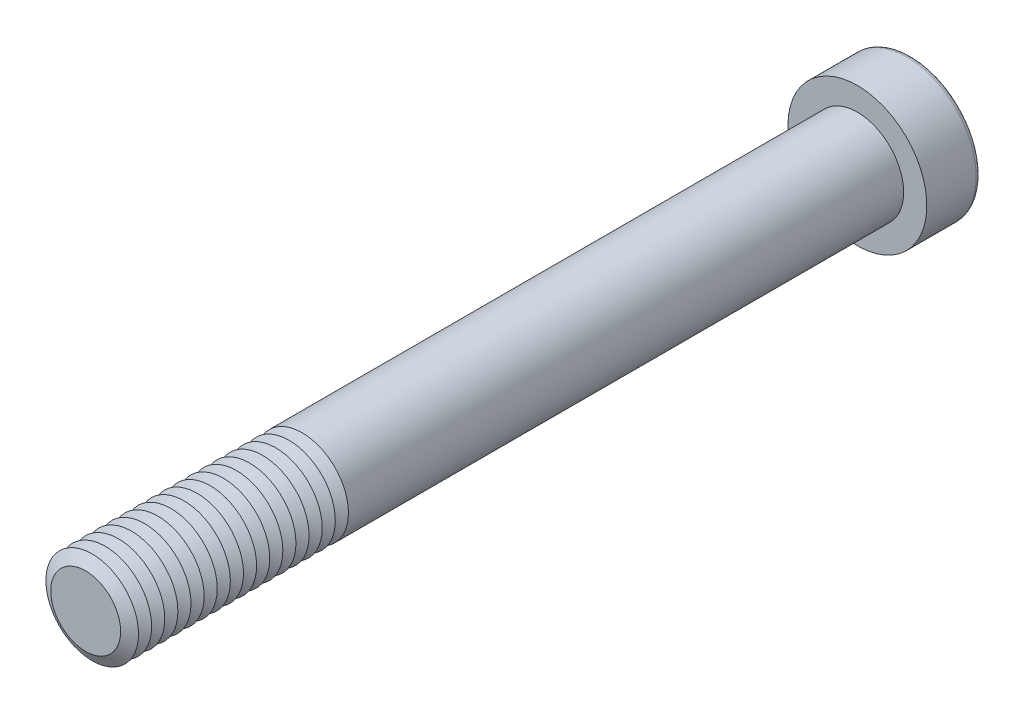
ISO-10303-21;
HEADER;
FILE_DESCRIPTION(('STEP AP214'),'2;1');
FILE_NAME('part.step','',(''),(''),'','','');
FILE_SCHEMA(('AUTOMOTIVE_DESIGN { 1 0 10303 214 1 1 1 1 }'));
ENDSEC;
DATA;
#1=APPLICATION_CONTEXT('core data for automotive mechanical design processes');
#2=APPLICATION_PROTOCOL_DEFINITION('international standard','automotive_design',2000,#1);
#3=PRODUCT_CONTEXT('',#1,'mechanical');
#4=PRODUCT('Part','Part','',(#3));
#5=PRODUCT_RELATED_PRODUCT_CATEGORY('part','',(#4));
#6=PRODUCT_DEFINITION_FORMATION('','',#4);
#7=PRODUCT_DEFINITION_CONTEXT('part definition',#1,'design');
#8=PRODUCT_DEFINITION('design','',#6,#7);
#9=PRODUCT_DEFINITION_SHAPE('','',#8);
#10=(LENGTH_UNIT() NAMED_UNIT(*) SI_UNIT(.MILLI.,.METRE.));
#11=(NAMED_UNIT(*) PLANE_ANGLE_UNIT() SI_UNIT($,.RADIAN.));
#12=(NAMED_UNIT(*) SI_UNIT($,.STERADIAN.) SOLID_ANGLE_UNIT());
#13=UNCERTAINTY_MEASURE_WITH_UNIT(LENGTH_MEASURE(1.E-05),#10,'distance_accuracy_value','');
#14=(GEOMETRIC_REPRESENTATION_CONTEXT(3) GLOBAL_UNCERTAINTY_ASSIGNED_CONTEXT((#13)) GLOBAL_UNIT_ASSIGNED_CONTEXT((#10,
#11,#12)) REPRESENTATION_CONTEXT('',''));
#15=CARTESIAN_POINT('',(0.,0.,0.));
#16=DIRECTION('',(0.,0.,1.));
#17=DIRECTION('',(1.,0.,0.));
#18=AXIS2_PLACEMENT_3D('',#15,#16,#17);
#19=CARTESIAN_POINT('',(0.,0.,94.05));
#20=DIRECTION('',(0.,0.,1.));
#21=DIRECTION('',(1.,0.,0.));
#22=AXIS2_PLACEMENT_3D('',#19,#20,#21);
#23=CONICAL_SURFACE('',#22,6.,1.0471975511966);
#24=CARTESIAN_POINT('',(0.,0.,93.2));
#25=DIRECTION('',(0.,0.,1.));
#26=DIRECTION('',(1.,0.,0.));
#27=AXIS2_PLACEMENT_3D('',#24,#25,#26);
#28=CIRCLE('',#27,4.52775681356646);
#29=CARTESIAN_POINT('',(4.52775681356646,0.,93.2));
#30=VERTEX_POINT('',#29);
#31=EDGE_CURVE('E313',#30,#30,#28,.T.);
#32=ORIENTED_EDGE('',*,*,#31,.T.);
#33=EDGE_LOOP('',(#32));
#34=FACE_BOUND('',#33,.T.);
#35=CARTESIAN_POINT('',(0.,0.,94.05));
#36=DIRECTION('',(0.,0.,1.));
#37=DIRECTION('',(1.,0.,0.));
#38=AXIS2_PLACEMENT_3D('',#35,#36,#37);
#39=CIRCLE('',#38,6.);
#40=CARTESIAN_POINT('',(6.,0.,94.05));
#41=VERTEX_POINT('',#40);
#42=EDGE_CURVE('E316',#41,#41,#39,.T.);
#43=ORIENTED_EDGE('',*,*,#42,.F.);
#44=EDGE_LOOP('',(#43));
#45=FACE_BOUND('',#44,.T.);
#46=ADVANCED_FACE('F39',(#34,#45),#23,.T.);
#47=CARTESIAN_POINT('',(0.,0.,93.2));
#48=DIRECTION('',(0.,0.,-1.));
#49=DIRECTION('',(-1.,0.,0.));
#50=AXIS2_PLACEMENT_3D('',#47,#48,#49);
#51=CONICAL_SURFACE('',#50,4.52775681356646,1.04719755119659);
#52=CARTESIAN_POINT('',(0.,0.,92.35));
#53=DIRECTION('',(0.,0.,1.));
#54=DIRECTION('',(1.,0.,0.));
#55=AXIS2_PLACEMENT_3D('',#52,#53,#54);
#56=CIRCLE('',#55,6.);
#57=CARTESIAN_POINT('',(6.,0.,92.35));
#58=VERTEX_POINT('',#57);
#59=EDGE_CURVE('E323',#58,#58,#56,.T.);
#60=ORIENTED_EDGE('',*,*,#59,.T.);
#61=EDGE_LOOP('',(#60));
#62=FACE_BOUND('',#61,.T.);
#63=ORIENTED_EDGE('',*,*,#31,.F.);
#64=EDGE_LOOP('',(#63));
#65=FACE_BOUND('',#64,.T.);
#66=ADVANCED_FACE('F244',(#62,#65),#51,.T.);
#67=CARTESIAN_POINT('',(0.,0.,100.));
#68=DIRECTION('',(0.,0.,1.));
#69=DIRECTION('',(1.,0.,0.));
#70=AXIS2_PLACEMENT_3D('',#67,#68,#69);
#71=PLANE('',#70);
#72=CARTESIAN_POINT('',(0.,0.,100.));
#73=DIRECTION('',(0.,0.,1.));
#74=DIRECTION('',(1.,0.,0.));
#75=AXIS2_PLACEMENT_3D('',#72,#73,#74);
#76=CIRCLE('',#75,4.52775681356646);
#77=CARTESIAN_POINT('',(4.52775681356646,0.,100.));
#78=VERTEX_POINT('',#77);
#79=EDGE_CURVE('E174',#78,#78,#76,.T.);
#80=ORIENTED_EDGE('',*,*,#79,.T.);
#81=EDGE_LOOP('',(#80));
#82=FACE_BOUND('',#81,.T.);
#83=ADVANCED_FACE('F250',(#82),#71,.T.);
#84=CARTESIAN_POINT('',(0.,0.,100.));
#85=DIRECTION('',(0.,0.,-1.));
#86=DIRECTION('',(-1.,0.,0.));
#87=AXIS2_PLACEMENT_3D('',#84,#85,#86);
#88=CONICAL_SURFACE('',#87,4.52775681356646,1.04719755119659);
#89=CARTESIAN_POINT('',(0.,0.,99.15));
#90=DIRECTION('',(0.,0.,1.));
#91=DIRECTION('',(1.,0.,0.));
#92=AXIS2_PLACEMENT_3D('',#89,#90,#91);
#93=CIRCLE('',#92,6.);
#94=CARTESIAN_POINT('',(6.,0.,99.15));
#95=VERTEX_POINT('',#94);
#96=EDGE_CURVE('E290',#95,#95,#93,.T.);
#97=ORIENTED_EDGE('',*,*,#96,.T.);
#98=EDGE_LOOP('',(#97));
#99=FACE_BOUND('',#98,.T.);
#100=ORIENTED_EDGE('',*,*,#79,.F.);
#101=EDGE_LOOP('',(#100));
#102=FACE_BOUND('',#101,.T.);
#103=ADVANCED_FACE('F199',(#99,#102),#88,.T.);
#104=CARTESIAN_POINT('',(0.,0.,99.15));
#105=DIRECTION('',(0.,0.,1.));
#106=DIRECTION('',(1.,0.,0.));
#107=AXIS2_PLACEMENT_3D('',#104,#105,#106);
#108=CONICAL_SURFACE('',#107,6.,1.0471975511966);
#109=CARTESIAN_POINT('',(0.,0.,98.3));
#110=DIRECTION('',(0.,0.,1.));
#111=DIRECTION('',(1.,0.,0.));
#112=AXIS2_PLACEMENT_3D('',#109,#110,#111);
#113=CIRCLE('',#112,4.52775681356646);
#114=CARTESIAN_POINT('',(4.52775681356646,0.,98.3));
#115=VERTEX_POINT('',#114);
#116=EDGE_CURVE('E287',#115,#115,#113,.T.);
#117=ORIENTED_EDGE('',*,*,#116,.T.);
#118=EDGE_LOOP('',(#117));
#119=FACE_BOUND('',#118,.T.);
#120=ORIENTED_EDGE('',*,*,#96,.F.);
#121=EDGE_LOOP('',(#120));
#122=FACE_BOUND('',#121,.T.);
#123=ADVANCED_FACE('F276',(#119,#122),#108,.T.);
#124=CARTESIAN_POINT('',(0.,0.,98.3));
#125=DIRECTION('',(0.,0.,-1.));
#126=DIRECTION('',(-1.,0.,0.));
#127=AXIS2_PLACEMENT_3D('',#124,#125,#126);
#128=CONICAL_SURFACE('',#127,4.52775681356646,1.04719755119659);
#129=CARTESIAN_POINT('',(0.,0.,97.45));
#130=DIRECTION('',(0.,0.,1.));
#131=DIRECTION('',(1.,0.,0.));
#132=AXIS2_PLACEMENT_3D('',#129,#130,#131);
#133=CIRCLE('',#132,6.);
#134=CARTESIAN_POINT('',(6.,0.,97.45));
#135=VERTEX_POINT('',#134);
#136=EDGE_CURVE('E299',#135,#135,#133,.T.);
#137=ORIENTED_EDGE('',*,*,#136,.T.);
#138=EDGE_LOOP('',(#137));
#139=FACE_BOUND('',#138,.T.);
#140=ORIENTED_EDGE('',*,*,#116,.F.);
#141=EDGE_LOOP('',(#140));
#142=FACE_BOUND('',#141,.T.);
#143=ADVANCED_FACE('F273',(#139,#142),#128,.T.);
#144=CARTESIAN_POINT('',(0.,0.,97.45));
#145=DIRECTION('',(0.,0.,1.));
#146=DIRECTION('',(1.,0.,0.));
#147=AXIS2_PLACEMENT_3D('',#144,#145,#146);
#148=CONICAL_SURFACE('',#147,6.,1.0471975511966);
#149=CARTESIAN_POINT('',(0.,0.,96.6));
#150=DIRECTION('',(0.,0.,1.));
#151=DIRECTION('',(1.,0.,0.));
#152=AXIS2_PLACEMENT_3D('',#149,#150,#151);
#153=CIRCLE('',#152,4.52775681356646);
#154=CARTESIAN_POINT('',(4.52775681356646,0.,96.6));
#155=VERTEX_POINT('',#154);
#156=EDGE_CURVE('E292',#155,#155,#153,.T.);
#157=ORIENTED_EDGE('',*,*,#156,.T.);
#158=EDGE_LOOP('',(#157));
#159=FACE_BOUND('',#158,.T.);
#160=ORIENTED_EDGE('',*,*,#136,.F.);
#161=EDGE_LOOP('',(#160));
#162=FACE_BOUND('',#161,.T.);
#163=ADVANCED_FACE('F269',(#159,#162),#148,.T.);
#164=CARTESIAN_POINT('',(0.,0.,96.6));
#165=DIRECTION('',(0.,0.,-1.));
#166=DIRECTION('',(-1.,0.,0.));
#167=AXIS2_PLACEMENT_3D('',#164,#165,#166);
#168=CONICAL_SURFACE('',#167,4.52775681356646,1.04719755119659);
#169=CARTESIAN_POINT('',(0.,0.,95.75));
#170=DIRECTION('',(0.,0.,1.));
#171=DIRECTION('',(1.,0.,0.));
#172=AXIS2_PLACEMENT_3D('',#169,#170,#171);
#173=CIRCLE('',#172,6.);
#174=CARTESIAN_POINT('',(6.,0.,95.75));
#175=VERTEX_POINT('',#174);
#176=EDGE_CURVE('E309',#175,#175,#173,.T.);
#177=ORIENTED_EDGE('',*,*,#176,.T.);
#178=EDGE_LOOP('',(#177));
#179=FACE_BOUND('',#178,.T.);
#180=ORIENTED_EDGE('',*,*,#156,.F.);
#181=EDGE_LOOP('',(#180));
#182=FACE_BOUND('',#181,.T.);
#183=ADVANCED_FACE('F265',(#179,#182),#168,.T.);
#184=CARTESIAN_POINT('',(0.,0.,95.75));
#185=DIRECTION('',(0.,0.,1.));
#186=DIRECTION('',(1.,0.,0.));
#187=AXIS2_PLACEMENT_3D('',#184,#185,#186);
#188=CONICAL_SURFACE('',#187,6.,1.0471975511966);
#189=CARTESIAN_POINT('',(0.,0.,94.9));
#190=DIRECTION('',(0.,0.,1.));
#191=DIRECTION('',(1.,0.,0.));
#192=AXIS2_PLACEMENT_3D('',#189,#190,#191);
#193=CIRCLE('',#192,4.52775681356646);
#194=CARTESIAN_POINT('',(4.52775681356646,0.,94.9));
#195=VERTEX_POINT('',#194);
#196=EDGE_CURVE('E305',#195,#195,#193,.T.);
#197=ORIENTED_EDGE('',*,*,#196,.T.);
#198=EDGE_LOOP('',(#197));
#199=FACE_BOUND('',#198,.T.);
#200=ORIENTED_EDGE('',*,*,#176,.F.);
#201=EDGE_LOOP('',(#200));
#202=FACE_BOUND('',#201,.T.);
#203=ADVANCED_FACE('F261',(#199,#202),#188,.T.);
#204=CARTESIAN_POINT('',(0.,0.,94.9));
#205=DIRECTION('',(0.,0.,-1.));
#206=DIRECTION('',(-1.,0.,0.));
#207=AXIS2_PLACEMENT_3D('',#204,#205,#206);
#208=CONICAL_SURFACE('',#207,4.52775681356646,1.04719755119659);
#209=ORIENTED_EDGE('',*,*,#42,.T.);
#210=EDGE_LOOP('',(#209));
#211=FACE_BOUND('',#210,.T.);
#212=ORIENTED_EDGE('',*,*,#196,.F.);
#213=EDGE_LOOP('',(#212));
#214=FACE_BOUND('',#213,.T.);
#215=ADVANCED_FACE('F257',(#211,#214),#208,.T.);
#216=CARTESIAN_POINT('',(0.,0.,92.35));
#217=DIRECTION('',(0.,0.,1.));
#218=DIRECTION('',(1.,0.,0.));
#219=AXIS2_PLACEMENT_3D('',#216,#217,#218);
#220=CONICAL_SURFACE('',#219,6.,1.0471975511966);
#221=CARTESIAN_POINT('',(0.,0.,91.5));
#222=DIRECTION('',(0.,0.,1.));
#223=DIRECTION('',(1.,0.,0.));
#224=AXIS2_PLACEMENT_3D('',#221,#222,#223);
#225=CIRCLE('',#224,4.52775681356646);
#226=CARTESIAN_POINT('',(4.52775681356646,0.,91.5));
#227=VERTEX_POINT('',#226);
#228=EDGE_CURVE('E320',#227,#227,#225,.T.);
#229=ORIENTED_EDGE('',*,*,#228,.T.);
#230=EDGE_LOOP('',(#229));
#231=FACE_BOUND('',#230,.T.);
#232=ORIENTED_EDGE('',*,*,#59,.F.);
#233=EDGE_LOOP('',(#232));
#234=FACE_BOUND('',#233,.T.);
#235=ADVANCED_FACE('F260',(#231,#234),#220,.T.);
#236=CARTESIAN_POINT('',(0.,0.,91.5));
#237=DIRECTION('',(0.,0.,-1.));
#238=DIRECTION('',(-1.,0.,0.));
#239=AXIS2_PLACEMENT_3D('',#236,#237,#238);
#240=CONICAL_SURFACE('',#239,4.52775681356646,1.04719755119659);
#241=CARTESIAN_POINT('',(0.,0.,90.65));
#242=DIRECTION('',(0.,0.,1.));
#243=DIRECTION('',(1.,0.,0.));
#244=AXIS2_PLACEMENT_3D('',#241,#242,#243);
#245=CIRCLE('',#244,6.);
#246=CARTESIAN_POINT('',(6.,0.,90.65));
#247=VERTEX_POINT('',#246);
#248=EDGE_CURVE('E330',#247,#247,#245,.T.);
#249=ORIENTED_EDGE('',*,*,#248,.T.);
#250=EDGE_LOOP('',(#249));
#251=FACE_BOUND('',#250,.T.);
#252=ORIENTED_EDGE('',*,*,#228,.F.);
#253=EDGE_LOOP('',(#252));
#254=FACE_BOUND('',#253,.T.);
#255=ADVANCED_FACE('F510',(#251,#254),#240,.T.);
#256=CARTESIAN_POINT('',(0.,0.,90.65));
#257=DIRECTION('',(0.,0.,1.));
#258=DIRECTION('',(1.,0.,0.));
#259=AXIS2_PLACEMENT_3D('',#256,#257,#258);
#260=CONICAL_SURFACE('',#259,6.,1.0471975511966);
#261=CARTESIAN_POINT('',(0.,0.,89.8));
#262=DIRECTION('',(0.,0.,1.));
#263=DIRECTION('',(1.,0.,0.));
#264=AXIS2_PLACEMENT_3D('',#261,#262,#263);
#265=CIRCLE('',#264,4.52775681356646);
#266=CARTESIAN_POINT('',(4.52775681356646,0.,89.8));
#267=VERTEX_POINT('',#266);
#268=EDGE_CURVE('E326',#267,#267,#265,.T.);
#269=ORIENTED_EDGE('',*,*,#268,.T.);
#270=EDGE_LOOP('',(#269));
#271=FACE_BOUND('',#270,.T.);
#272=ORIENTED_EDGE('',*,*,#248,.F.);
#273=EDGE_LOOP('',(#272));
#274=FACE_BOUND('',#273,.T.);
#275=ADVANCED_FACE('F506',(#271,#274),#260,.T.);
#276=CARTESIAN_POINT('',(0.,0.,89.8));
#277=DIRECTION('',(0.,0.,-1.));
#278=DIRECTION('',(-1.,0.,0.));
#279=AXIS2_PLACEMENT_3D('',#276,#277,#278);
#280=CONICAL_SURFACE('',#279,4.52775681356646,1.04719755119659);
#281=CARTESIAN_POINT('',(0.,0.,88.95));
#282=DIRECTION('',(0.,0.,1.));
#283=DIRECTION('',(1.,0.,0.));
#284=AXIS2_PLACEMENT_3D('',#281,#282,#283);
#285=CIRCLE('',#284,6.);
#286=CARTESIAN_POINT('',(6.,0.,88.95));
#287=VERTEX_POINT('',#286);
#288=EDGE_CURVE('E338',#287,#287,#285,.T.);
#289=ORIENTED_EDGE('',*,*,#288,.T.);
#290=EDGE_LOOP('',(#289));
#291=FACE_BOUND('',#290,.T.);
#292=ORIENTED_EDGE('',*,*,#268,.F.);
#293=EDGE_LOOP('',(#292));
#294=FACE_BOUND('',#293,.T.);
#295=ADVANCED_FACE('F502',(#291,#294),#280,.T.);
#296=CARTESIAN_POINT('',(0.,0.,88.95));
#297=DIRECTION('',(0.,0.,1.));
#298=DIRECTION('',(1.,0.,0.));
#299=AXIS2_PLACEMENT_3D('',#296,#297,#298);
#300=CONICAL_SURFACE('',#299,6.,1.0471975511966);
#301=CARTESIAN_POINT('',(0.,0.,88.1));
#302=DIRECTION('',(0.,0.,1.));
#303=DIRECTION('',(1.,0.,0.));
#304=AXIS2_PLACEMENT_3D('',#301,#302,#303);
#305=CIRCLE('',#304,4.52775681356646);
#306=CARTESIAN_POINT('',(4.52775681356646,0.,88.1));
#307=VERTEX_POINT('',#306);
#308=EDGE_CURVE('E334',#307,#307,#305,.T.);
#309=ORIENTED_EDGE('',*,*,#308,.T.);
#310=EDGE_LOOP('',(#309));
#311=FACE_BOUND('',#310,.T.);
#312=ORIENTED_EDGE('',*,*,#288,.F.);
#313=EDGE_LOOP('',(#312));
#314=FACE_BOUND('',#313,.T.);
#315=ADVANCED_FACE('F498',(#311,#314),#300,.T.);
#316=CARTESIAN_POINT('',(0.,0.,88.1));
#317=DIRECTION('',(0.,0.,-1.));
#318=DIRECTION('',(-1.,0.,0.));
#319=AXIS2_PLACEMENT_3D('',#316,#317,#318);
#320=CONICAL_SURFACE('',#319,4.52775681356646,1.04719755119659);
#321=CARTESIAN_POINT('',(0.,0.,87.25));
#322=DIRECTION('',(0.,0.,1.));
#323=DIRECTION('',(1.,0.,0.));
#324=AXIS2_PLACEMENT_3D('',#321,#322,#323);
#325=CIRCLE('',#324,6.);
#326=CARTESIAN_POINT('',(6.,0.,87.25));
#327=VERTEX_POINT('',#326);
#328=EDGE_CURVE('E345',#327,#327,#325,.T.);
#329=ORIENTED_EDGE('',*,*,#328,.T.);
#330=EDGE_LOOP('',(#329));
#331=FACE_BOUND('',#330,.T.);
#332=ORIENTED_EDGE('',*,*,#308,.F.);
#333=EDGE_LOOP('',(#332));
#334=FACE_BOUND('',#333,.T.);
#335=ADVANCED_FACE('F494',(#331,#334),#320,.T.);
#336=CARTESIAN_POINT('',(0.,0.,87.25));
#337=DIRECTION('',(0.,0.,1.));
#338=DIRECTION('',(1.,0.,0.));
#339=AXIS2_PLACEMENT_3D('',#336,#337,#338);
#340=CONICAL_SURFACE('',#339,6.,1.0471975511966);
#341=CARTESIAN_POINT('',(0.,0.,86.4));
#342=DIRECTION('',(0.,0.,1.));
#343=DIRECTION('',(1.,0.,0.));
#344=AXIS2_PLACEMENT_3D('',#341,#342,#343);
#345=CIRCLE('',#344,4.52775681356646);
#346=CARTESIAN_POINT('',(4.52775681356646,0.,86.4));
#347=VERTEX_POINT('',#346);
#348=EDGE_CURVE('E342',#347,#347,#345,.T.);
#349=ORIENTED_EDGE('',*,*,#348,.T.);
#350=EDGE_LOOP('',(#349));
#351=FACE_BOUND('',#350,.T.);
#352=ORIENTED_EDGE('',*,*,#328,.F.);
#353=EDGE_LOOP('',(#352));
#354=FACE_BOUND('',#353,.T.);
#355=ADVANCED_FACE('F490',(#351,#354),#340,.T.);
#356=CARTESIAN_POINT('',(0.,0.,86.4));
#357=DIRECTION('',(0.,0.,-1.));
#358=DIRECTION('',(-1.,0.,0.));
#359=AXIS2_PLACEMENT_3D('',#356,#357,#358);
#360=CONICAL_SURFACE('',#359,4.52775681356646,1.04719755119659);
#361=CARTESIAN_POINT('',(0.,0.,85.55));
#362=DIRECTION('',(0.,0.,1.));
#363=DIRECTION('',(1.,0.,0.));
#364=AXIS2_PLACEMENT_3D('',#361,#362,#363);
#365=CIRCLE('',#364,6.);
#366=CARTESIAN_POINT('',(6.,0.,85.55));
#367=VERTEX_POINT('',#366);
#368=EDGE_CURVE('E353',#367,#367,#365,.T.);
#369=ORIENTED_EDGE('',*,*,#368,.T.);
#370=EDGE_LOOP('',(#369));
#371=FACE_BOUND('',#370,.T.);
#372=ORIENTED_EDGE('',*,*,#348,.F.);
#373=EDGE_LOOP('',(#372));
#374=FACE_BOUND('',#373,.T.);
#375=ADVANCED_FACE('F486',(#371,#374),#360,.T.);
#376=CARTESIAN_POINT('',(0.,0.,85.55));
#377=DIRECTION('',(0.,0.,1.));
#378=DIRECTION('',(1.,0.,0.));
#379=AXIS2_PLACEMENT_3D('',#376,#377,#378);
#380=CONICAL_SURFACE('',#379,6.,1.0471975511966);
#381=CARTESIAN_POINT('',(0.,0.,84.7));
#382=DIRECTION('',(0.,0.,1.));
#383=DIRECTION('',(1.,0.,0.));
#384=AXIS2_PLACEMENT_3D('',#381,#382,#383);
#385=CIRCLE('',#384,4.52775681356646);
#386=CARTESIAN_POINT('',(4.52775681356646,0.,84.7));
#387=VERTEX_POINT('',#386);
#388=EDGE_CURVE('E349',#387,#387,#385,.T.);
#389=ORIENTED_EDGE('',*,*,#388,.T.);
#390=EDGE_LOOP('',(#389));
#391=FACE_BOUND('',#390,.T.);
#392=ORIENTED_EDGE('',*,*,#368,.F.);
#393=EDGE_LOOP('',(#392));
#394=FACE_BOUND('',#393,.T.);
#395=ADVANCED_FACE('F482',(#391,#394),#380,.T.);
#396=CARTESIAN_POINT('',(0.,0.,84.7));
#397=DIRECTION('',(0.,0.,-1.));
#398=DIRECTION('',(-1.,0.,0.));
#399=AXIS2_PLACEMENT_3D('',#396,#397,#398);
#400=CONICAL_SURFACE('',#399,4.52775681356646,1.04719755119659);
#401=CARTESIAN_POINT('',(0.,0.,83.85));
#402=DIRECTION('',(0.,0.,1.));
#403=DIRECTION('',(1.,0.,0.));
#404=AXIS2_PLACEMENT_3D('',#401,#402,#403);
#405=CIRCLE('',#404,6.);
#406=CARTESIAN_POINT('',(6.,0.,83.85));
#407=VERTEX_POINT('',#406);
#408=EDGE_CURVE('E361',#407,#407,#405,.T.);
#409=ORIENTED_EDGE('',*,*,#408,.T.);
#410=EDGE_LOOP('',(#409));
#411=FACE_BOUND('',#410,.T.);
#412=ORIENTED_EDGE('',*,*,#388,.F.);
#413=EDGE_LOOP('',(#412));
#414=FACE_BOUND('',#413,.T.);
#415=ADVANCED_FACE('F478',(#411,#414),#400,.T.);
#416=CARTESIAN_POINT('',(0.,0.,83.85));
#417=DIRECTION('',(0.,0.,1.));
#418=DIRECTION('',(1.,0.,0.));
#419=AXIS2_PLACEMENT_3D('',#416,#417,#418);
#420=CONICAL_SURFACE('',#419,6.,1.0471975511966);
#421=CARTESIAN_POINT('',(0.,0.,83.));
#422=DIRECTION('',(0.,0.,1.));
#423=DIRECTION('',(1.,0.,0.));
#424=AXIS2_PLACEMENT_3D('',#421,#422,#423);
#425=CIRCLE('',#424,4.52775681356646);
#426=CARTESIAN_POINT('',(4.52775681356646,0.,83.));
#427=VERTEX_POINT('',#426);
#428=EDGE_CURVE('E357',#427,#427,#425,.T.);
#429=ORIENTED_EDGE('',*,*,#428,.T.);
#430=EDGE_LOOP('',(#429));
#431=FACE_BOUND('',#430,.T.);
#432=ORIENTED_EDGE('',*,*,#408,.F.);
#433=EDGE_LOOP('',(#432));
#434=FACE_BOUND('',#433,.T.);
#435=ADVANCED_FACE('F474',(#431,#434),#420,.T.);
#436=CARTESIAN_POINT('',(0.,0.,83.));
#437=DIRECTION('',(0.,0.,-1.));
#438=DIRECTION('',(-1.,0.,0.));
#439=AXIS2_PLACEMENT_3D('',#436,#437,#438);
#440=CONICAL_SURFACE('',#439,4.52775681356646,1.04719755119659);
#441=CARTESIAN_POINT('',(0.,0.,82.15));
#442=DIRECTION('',(0.,0.,1.));
#443=DIRECTION('',(1.,0.,0.));
#444=AXIS2_PLACEMENT_3D('',#441,#442,#443);
#445=CIRCLE('',#444,6.);
#446=CARTESIAN_POINT('',(6.,0.,82.15));
#447=VERTEX_POINT('',#446);
#448=EDGE_CURVE('E369',#447,#447,#445,.T.);
#449=ORIENTED_EDGE('',*,*,#448,.T.);
#450=EDGE_LOOP('',(#449));
#451=FACE_BOUND('',#450,.T.);
#452=ORIENTED_EDGE('',*,*,#428,.F.);
#453=EDGE_LOOP('',(#452));
#454=FACE_BOUND('',#453,.T.);
#455=ADVANCED_FACE('F470',(#451,#454),#440,.T.);
#456=CARTESIAN_POINT('',(0.,0.,82.15));
#457=DIRECTION('',(0.,0.,1.));
#458=DIRECTION('',(1.,0.,0.));
#459=AXIS2_PLACEMENT_3D('',#456,#457,#458);
#460=CONICAL_SURFACE('',#459,6.,1.0471975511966);
#461=CARTESIAN_POINT('',(0.,0.,81.3));
#462=DIRECTION('',(0.,0.,1.));
#463=DIRECTION('',(1.,0.,0.));
#464=AXIS2_PLACEMENT_3D('',#461,#462,#463);
#465=CIRCLE('',#464,4.52775681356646);
#466=CARTESIAN_POINT('',(4.52775681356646,0.,81.3));
#467=VERTEX_POINT('',#466);
#468=EDGE_CURVE('E365',#467,#467,#465,.T.);
#469=ORIENTED_EDGE('',*,*,#468,.T.);
#470=EDGE_LOOP('',(#469));
#471=FACE_BOUND('',#470,.T.);
#472=ORIENTED_EDGE('',*,*,#448,.F.);
#473=EDGE_LOOP('',(#472));
#474=FACE_BOUND('',#473,.T.);
#475=ADVANCED_FACE('F466',(#471,#474),#460,.T.);
#476=CARTESIAN_POINT('',(0.,0.,81.3));
#477=DIRECTION('',(0.,0.,-1.));
#478=DIRECTION('',(-1.,0.,0.));
#479=AXIS2_PLACEMENT_3D('',#476,#477,#478);
#480=CONICAL_SURFACE('',#479,4.52775681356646,1.04719755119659);
#481=CARTESIAN_POINT('',(0.,0.,80.45));
#482=DIRECTION('',(0.,0.,1.));
#483=DIRECTION('',(1.,0.,0.));
#484=AXIS2_PLACEMENT_3D('',#481,#482,#483);
#485=CIRCLE('',#484,6.);
#486=CARTESIAN_POINT('',(6.,0.,80.45));
#487=VERTEX_POINT('',#486);
#488=EDGE_CURVE('E377',#487,#487,#485,.T.);
#489=ORIENTED_EDGE('',*,*,#488,.T.);
#490=EDGE_LOOP('',(#489));
#491=FACE_BOUND('',#490,.T.);
#492=ORIENTED_EDGE('',*,*,#468,.F.);
#493=EDGE_LOOP('',(#492));
#494=FACE_BOUND('',#493,.T.);
#495=ADVANCED_FACE('F462',(#491,#494),#480,.T.);
#496=CARTESIAN_POINT('',(0.,0.,80.45));
#497=DIRECTION('',(0.,0.,1.));
#498=DIRECTION('',(1.,0.,0.));
#499=AXIS2_PLACEMENT_3D('',#496,#497,#498);
#500=CONICAL_SURFACE('',#499,6.,1.0471975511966);
#501=CARTESIAN_POINT('',(0.,0.,79.6));
#502=DIRECTION('',(0.,0.,1.));
#503=DIRECTION('',(1.,0.,0.));
#504=AXIS2_PLACEMENT_3D('',#501,#502,#503);
#505=CIRCLE('',#504,4.52775681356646);
#506=CARTESIAN_POINT('',(4.52775681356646,0.,79.6));
#507=VERTEX_POINT('',#506);
#508=EDGE_CURVE('E373',#507,#507,#505,.T.);
#509=ORIENTED_EDGE('',*,*,#508,.T.);
#510=EDGE_LOOP('',(#509));
#511=FACE_BOUND('',#510,.T.);
#512=ORIENTED_EDGE('',*,*,#488,.F.);
#513=EDGE_LOOP('',(#512));
#514=FACE_BOUND('',#513,.T.);
#515=ADVANCED_FACE('F458',(#511,#514),#500,.T.);
#516=CARTESIAN_POINT('',(0.,0.,79.6));
#517=DIRECTION('',(0.,0.,-1.));
#518=DIRECTION('',(-1.,0.,0.));
#519=AXIS2_PLACEMENT_3D('',#516,#517,#518);
#520=CONICAL_SURFACE('',#519,4.52775681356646,1.04719755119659);
#521=CARTESIAN_POINT('',(0.,0.,78.75));
#522=DIRECTION('',(0.,0.,1.));
#523=DIRECTION('',(1.,0.,0.));
#524=AXIS2_PLACEMENT_3D('',#521,#522,#523);
#525=CIRCLE('',#524,6.);
#526=CARTESIAN_POINT('',(6.,0.,78.75));
#527=VERTEX_POINT('',#526);
#528=EDGE_CURVE('E385',#527,#527,#525,.T.);
#529=ORIENTED_EDGE('',*,*,#528,.T.);
#530=EDGE_LOOP('',(#529));
#531=FACE_BOUND('',#530,.T.);
#532=ORIENTED_EDGE('',*,*,#508,.F.);
#533=EDGE_LOOP('',(#532));
#534=FACE_BOUND('',#533,.T.);
#535=ADVANCED_FACE('F454',(#531,#534),#520,.T.);
#536=CARTESIAN_POINT('',(0.,0.,78.75));
#537=DIRECTION('',(0.,0.,1.));
#538=DIRECTION('',(1.,0.,0.));
#539=AXIS2_PLACEMENT_3D('',#536,#537,#538);
#540=CONICAL_SURFACE('',#539,6.,1.0471975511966);
#541=CARTESIAN_POINT('',(0.,0.,77.9));
#542=DIRECTION('',(0.,0.,1.));
#543=DIRECTION('',(1.,0.,0.));
#544=AXIS2_PLACEMENT_3D('',#541,#542,#543);
#545=CIRCLE('',#544,4.52775681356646);
#546=CARTESIAN_POINT('',(4.52775681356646,0.,77.9));
#547=VERTEX_POINT('',#546);
#548=EDGE_CURVE('E381',#547,#547,#545,.T.);
#549=ORIENTED_EDGE('',*,*,#548,.T.);
#550=EDGE_LOOP('',(#549));
#551=FACE_BOUND('',#550,.T.);
#552=ORIENTED_EDGE('',*,*,#528,.F.);
#553=EDGE_LOOP('',(#552));
#554=FACE_BOUND('',#553,.T.);
#555=ADVANCED_FACE('F450',(#551,#554),#540,.T.);
#556=CARTESIAN_POINT('',(0.,0.,77.9));
#557=DIRECTION('',(0.,0.,-1.));
#558=DIRECTION('',(-1.,0.,0.));
#559=AXIS2_PLACEMENT_3D('',#556,#557,#558);
#560=CONICAL_SURFACE('',#559,4.52775681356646,1.04719755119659);
#561=CARTESIAN_POINT('',(0.,0.,77.05));
#562=DIRECTION('',(0.,0.,1.));
#563=DIRECTION('',(1.,0.,0.));
#564=AXIS2_PLACEMENT_3D('',#561,#562,#563);
#565=CIRCLE('',#564,6.);
#566=CARTESIAN_POINT('',(6.,0.,77.05));
#567=VERTEX_POINT('',#566);
#568=EDGE_CURVE('E393',#567,#567,#565,.T.);
#569=ORIENTED_EDGE('',*,*,#568,.T.);
#570=EDGE_LOOP('',(#569));
#571=FACE_BOUND('',#570,.T.);
#572=ORIENTED_EDGE('',*,*,#548,.F.);
#573=EDGE_LOOP('',(#572));
#574=FACE_BOUND('',#573,.T.);
#575=ADVANCED_FACE('F446',(#571,#574),#560,.T.);
#576=CARTESIAN_POINT('',(0.,0.,77.05));
#577=DIRECTION('',(0.,0.,1.));
#578=DIRECTION('',(1.,0.,0.));
#579=AXIS2_PLACEMENT_3D('',#576,#577,#578);
#580=CONICAL_SURFACE('',#579,6.,1.0471975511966);
#581=CARTESIAN_POINT('',(0.,0.,76.2));
#582=DIRECTION('',(0.,0.,1.));
#583=DIRECTION('',(1.,0.,0.));
#584=AXIS2_PLACEMENT_3D('',#581,#582,#583);
#585=CIRCLE('',#584,4.52775681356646);
#586=CARTESIAN_POINT('',(4.52775681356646,0.,76.2));
#587=VERTEX_POINT('',#586);
#588=EDGE_CURVE('E389',#587,#587,#585,.T.);
#589=ORIENTED_EDGE('',*,*,#588,.T.);
#590=EDGE_LOOP('',(#589));
#591=FACE_BOUND('',#590,.T.);
#592=ORIENTED_EDGE('',*,*,#568,.F.);
#593=EDGE_LOOP('',(#592));
#594=FACE_BOUND('',#593,.T.);
#595=ADVANCED_FACE('F442',(#591,#594),#580,.T.);
#596=CARTESIAN_POINT('',(0.,0.,76.2));
#597=DIRECTION('',(0.,0.,-1.));
#598=DIRECTION('',(-1.,0.,0.));
#599=AXIS2_PLACEMENT_3D('',#596,#597,#598);
#600=CONICAL_SURFACE('',#599,4.52775681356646,1.04719755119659);
#601=CARTESIAN_POINT('',(0.,0.,75.35));
#602=DIRECTION('',(0.,0.,1.));
#603=DIRECTION('',(1.,0.,0.));
#604=AXIS2_PLACEMENT_3D('',#601,#602,#603);
#605=CIRCLE('',#604,6.);
#606=CARTESIAN_POINT('',(6.,0.,75.35));
#607=VERTEX_POINT('',#606);
#608=EDGE_CURVE('E401',#607,#607,#605,.T.);
#609=ORIENTED_EDGE('',*,*,#608,.T.);
#610=EDGE_LOOP('',(#609));
#611=FACE_BOUND('',#610,.T.);
#612=ORIENTED_EDGE('',*,*,#588,.F.);
#613=EDGE_LOOP('',(#612));
#614=FACE_BOUND('',#613,.T.);
#615=ADVANCED_FACE('F438',(#611,#614),#600,.T.);
#616=CARTESIAN_POINT('',(0.,0.,75.35));
#617=DIRECTION('',(0.,0.,1.));
#618=DIRECTION('',(1.,0.,0.));
#619=AXIS2_PLACEMENT_3D('',#616,#617,#618);
#620=CONICAL_SURFACE('',#619,6.,1.0471975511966);
#621=CARTESIAN_POINT('',(0.,0.,74.5));
#622=DIRECTION('',(0.,0.,1.));
#623=DIRECTION('',(1.,0.,0.));
#624=AXIS2_PLACEMENT_3D('',#621,#622,#623);
#625=CIRCLE('',#624,4.52775681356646);
#626=CARTESIAN_POINT('',(4.52775681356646,0.,74.5));
#627=VERTEX_POINT('',#626);
#628=EDGE_CURVE('E397',#627,#627,#625,.T.);
#629=ORIENTED_EDGE('',*,*,#628,.T.);
#630=EDGE_LOOP('',(#629));
#631=FACE_BOUND('',#630,.T.);
#632=ORIENTED_EDGE('',*,*,#608,.F.);
#633=EDGE_LOOP('',(#632));
#634=FACE_BOUND('',#633,.T.);
#635=ADVANCED_FACE('F433',(#631,#634),#620,.T.);
#636=CARTESIAN_POINT('',(0.,0.,74.5));
#637=DIRECTION('',(0.,0.,-1.));
#638=DIRECTION('',(-1.,0.,0.));
#639=AXIS2_PLACEMENT_3D('',#636,#637,#638);
#640=CONICAL_SURFACE('',#639,4.52775681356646,1.04719755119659);
#641=CARTESIAN_POINT('',(0.,0.,73.65));
#642=DIRECTION('',(0.,0.,1.));
#643=DIRECTION('',(1.,0.,0.));
#644=AXIS2_PLACEMENT_3D('',#641,#642,#643);
#645=CIRCLE('',#644,6.);
#646=CARTESIAN_POINT('',(6.,0.,73.65));
#647=VERTEX_POINT('',#646);
#648=EDGE_CURVE('E413',#647,#647,#645,.T.);
#649=ORIENTED_EDGE('',*,*,#648,.T.);
#650=EDGE_LOOP('',(#649));
#651=FACE_BOUND('',#650,.T.);
#652=ORIENTED_EDGE('',*,*,#628,.F.);
#653=EDGE_LOOP('',(#652));
#654=FACE_BOUND('',#653,.T.);
#655=ADVANCED_FACE('F419',(#651,#654),#640,.T.);
#656=CARTESIAN_POINT('',(0.,0.,73.65));
#657=DIRECTION('',(0.,0.,1.));
#658=DIRECTION('',(1.,0.,0.));
#659=AXIS2_PLACEMENT_3D('',#656,#657,#658);
#660=CONICAL_SURFACE('',#659,6.,1.0471975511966);
#661=CARTESIAN_POINT('',(0.,0.,72.8));
#662=DIRECTION('',(0.,0.,1.));
#663=DIRECTION('',(1.,0.,0.));
#664=AXIS2_PLACEMENT_3D('',#661,#662,#663);
#665=CIRCLE('',#664,4.52775681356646);
#666=CARTESIAN_POINT('',(4.52775681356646,0.,72.8));
#667=VERTEX_POINT('',#666);
#668=EDGE_CURVE('E405',#667,#667,#665,.T.);
#669=ORIENTED_EDGE('',*,*,#668,.T.);
#670=EDGE_LOOP('',(#669));
#671=FACE_BOUND('',#670,.T.);
#672=ORIENTED_EDGE('',*,*,#648,.F.);
#673=EDGE_LOOP('',(#672));
#674=FACE_BOUND('',#673,.T.);
#675=ADVANCED_FACE('F422',(#671,#674),#660,.T.);
#676=CARTESIAN_POINT('',(0.,0.,72.8));
#677=DIRECTION('',(0.,0.,-1.));
#678=DIRECTION('',(-1.,0.,0.));
#679=AXIS2_PLACEMENT_3D('',#676,#677,#678);
#680=CONICAL_SURFACE('',#679,4.52775681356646,1.04719755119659);
#681=CARTESIAN_POINT('',(0.,0.,71.95));
#682=DIRECTION('',(0.,0.,1.));
#683=DIRECTION('',(1.,0.,0.));
#684=AXIS2_PLACEMENT_3D('',#681,#682,#683);
#685=CIRCLE('',#684,6.);
#686=CARTESIAN_POINT('',(6.,0.,71.95));
#687=VERTEX_POINT('',#686);
#688=EDGE_CURVE('E409',#687,#687,#685,.T.);
#689=ORIENTED_EDGE('',*,*,#688,.T.);
#690=EDGE_LOOP('',(#689));
#691=FACE_BOUND('',#690,.T.);
#692=ORIENTED_EDGE('',*,*,#668,.F.);
#693=EDGE_LOOP('',(#692));
#694=FACE_BOUND('',#693,.T.);
#695=ADVANCED_FACE('F424',(#691,#694),#680,.T.);
#696=CARTESIAN_POINT('',(0.,0.,-1.));
#697=DIRECTION('',(0.,0.,-1.));
#698=DIRECTION('',(-1.,0.,0.));
#699=AXIS2_PLACEMENT_3D('',#696,#697,#698);
#700=CONICAL_SURFACE('',#699,4.,1.0471975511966);
#701=CARTESIAN_POINT('',(0.,0.,1.30940107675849));
#702=VERTEX_POINT('',#701);
#703=VERTEX_LOOP('',#702);
#704=FACE_BOUND('',#703,.T.);
#705=CARTESIAN_POINT('',(0.,0.,-1.));
#706=DIRECTION('',(0.,0.,-1.));
#707=DIRECTION('',(-1.,0.,0.));
#708=AXIS2_PLACEMENT_3D('',#705,#706,#707);
#709=CIRCLE('',#708,4.);
#710=CARTESIAN_POINT('',(-3.46410161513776,2.,-1.));
#711=VERTEX_POINT('',#710);
#712=CARTESIAN_POINT('',(0.,4.,-1.));
#713=VERTEX_POINT('',#712);
#714=EDGE_CURVE('E149',#711,#713,#709,.T.);
#715=ORIENTED_EDGE('',*,*,#714,.T.);
#716=CARTESIAN_POINT('',(0.,0.,-1.));
#717=DIRECTION('',(0.,0.,-1.));
#718=DIRECTION('',(-1.,0.,0.));
#719=AXIS2_PLACEMENT_3D('',#716,#717,#718);
#720=CIRCLE('',#719,4.);
#721=CARTESIAN_POINT('',(3.46410161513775,2.,-1.));
#722=VERTEX_POINT('',#721);
#723=EDGE_CURVE('E54',#713,#722,#720,.T.);
#724=ORIENTED_EDGE('',*,*,#723,.T.);
#725=CARTESIAN_POINT('',(3.46410161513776,-2.,-1.));
#726=VERTEX_POINT('',#725);
#727=EDGE_CURVE('E1025',#722,#726,#720,.T.);
#728=ORIENTED_EDGE('',*,*,#727,.T.);
#729=CARTESIAN_POINT('',(0.,-4.,-1.));
#730=VERTEX_POINT('',#729);
#731=EDGE_CURVE('E1023',#726,#730,#720,.T.);
#732=ORIENTED_EDGE('',*,*,#731,.T.);
#733=CARTESIAN_POINT('',(-3.46410161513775,-2.,-1.));
#734=VERTEX_POINT('',#733);
#735=EDGE_CURVE('E1018',#730,#734,#720,.T.);
#736=ORIENTED_EDGE('',*,*,#735,.T.);
#737=EDGE_CURVE('E1016',#734,#711,#720,.T.);
#738=ORIENTED_EDGE('',*,*,#737,.T.);
#739=EDGE_LOOP('',(#715,#724,#728,#732,#736,#738));
#740=FACE_BOUND('',#739,.T.);
#741=ADVANCED_FACE('F201',(#704,#740),#700,.F.);
#742=CARTESIAN_POINT('',(0.,0.,-1.));
#743=DIRECTION('',(0.,0.,-1.));
#744=DIRECTION('',(-1.,0.,0.));
#745=AXIS2_PLACEMENT_3D('',#742,#743,#744);
#746=PLANE('',#745);
#747=ORIENTED_EDGE('',*,*,#723,.F.);
#748=DIRECTION('',(1.,0.,0.));
#749=VECTOR('',#748,1.);
#750=CARTESIAN_POINT('',(-2.3094010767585,4.,-1.));
#751=LINE('',#750,#749);
#752=CARTESIAN_POINT('',(2.3094010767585,4.,-1.));
#753=VERTEX_POINT('',#752);
#754=EDGE_CURVE('E1065',#713,#753,#751,.T.);
#755=ORIENTED_EDGE('',*,*,#754,.T.);
#756=DIRECTION('',(0.5,-0.866025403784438,0.));
#757=VECTOR('',#756,1.);
#758=CARTESIAN_POINT('',(2.3094010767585,4.,-1.));
#759=LINE('',#758,#757);
#760=EDGE_CURVE('E155',#753,#722,#759,.T.);
#761=ORIENTED_EDGE('',*,*,#760,.T.);
#762=EDGE_LOOP('',(#747,#755,#761));
#763=FACE_BOUND('',#762,.T.);
#764=ADVANCED_FACE('F605',(#763),#746,.T.);
#765=ORIENTED_EDGE('',*,*,#727,.F.);
#766=CARTESIAN_POINT('',(4.61880215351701,0.,-1.));
#767=VERTEX_POINT('',#766);
#768=EDGE_CURVE('E1069',#722,#767,#759,.T.);
#769=ORIENTED_EDGE('',*,*,#768,.T.);
#770=DIRECTION('',(-0.5,-0.866025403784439,0.));
#771=VECTOR('',#770,1.);
#772=CARTESIAN_POINT('',(4.61880215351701,0.,-1.));
#773=LINE('',#772,#771);
#774=EDGE_CURVE('E1038',#767,#726,#773,.T.);
#775=ORIENTED_EDGE('',*,*,#774,.T.);
#776=EDGE_LOOP('',(#765,#769,#775));
#777=FACE_BOUND('',#776,.T.);
#778=ADVANCED_FACE('F615',(#777),#746,.T.);
#779=ORIENTED_EDGE('',*,*,#731,.F.);
#780=CARTESIAN_POINT('',(2.3094010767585,-4.,-1.));
#781=VERTEX_POINT('',#780);
#782=EDGE_CURVE('E1040',#726,#781,#773,.T.);
#783=ORIENTED_EDGE('',*,*,#782,.T.);
#784=DIRECTION('',(-1.,0.,0.));
#785=VECTOR('',#784,1.);
#786=CARTESIAN_POINT('',(2.3094010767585,-4.,-1.));
#787=LINE('',#786,#785);
#788=EDGE_CURVE('E990',#781,#730,#787,.T.);
#789=ORIENTED_EDGE('',*,*,#788,.T.);
#790=EDGE_LOOP('',(#779,#783,#789));
#791=FACE_BOUND('',#790,.T.);
#792=ADVANCED_FACE('F625',(#791),#746,.T.);
#793=ORIENTED_EDGE('',*,*,#735,.F.);
#794=CARTESIAN_POINT('',(-2.3094010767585,-4.,-1.));
#795=VERTEX_POINT('',#794);
#796=EDGE_CURVE('E1034',#730,#795,#787,.T.);
#797=ORIENTED_EDGE('',*,*,#796,.T.);
#798=DIRECTION('',(-0.5,0.866025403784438,0.));
#799=VECTOR('',#798,1.);
#800=CARTESIAN_POINT('',(-2.3094010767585,-4.,-1.));
#801=LINE('',#800,#799);
#802=EDGE_CURVE('E1036',#795,#734,#801,.T.);
#803=ORIENTED_EDGE('',*,*,#802,.T.);
#804=EDGE_LOOP('',(#793,#797,#803));
#805=FACE_BOUND('',#804,.T.);
#806=ADVANCED_FACE('F633',(#805),#746,.T.);
#807=ORIENTED_EDGE('',*,*,#737,.F.);
#808=CARTESIAN_POINT('',(-4.61880215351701,0.,-1.));
#809=VERTEX_POINT('',#808);
#810=EDGE_CURVE('E1042',#734,#809,#801,.T.);
#811=ORIENTED_EDGE('',*,*,#810,.T.);
#812=DIRECTION('',(0.5,0.866025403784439,0.));
#813=VECTOR('',#812,1.);
#814=CARTESIAN_POINT('',(-4.61880215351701,0.,-1.));
#815=LINE('',#814,#813);
#816=EDGE_CURVE('E158',#809,#711,#815,.T.);
#817=ORIENTED_EDGE('',*,*,#816,.T.);
#818=EDGE_LOOP('',(#807,#811,#817));
#819=FACE_BOUND('',#818,.T.);
#820=ADVANCED_FACE('F230',(#819),#746,.T.);
#821=ORIENTED_EDGE('',*,*,#714,.F.);
#822=CARTESIAN_POINT('',(-2.3094010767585,4.,-1.));
#823=VERTEX_POINT('',#822);
#824=EDGE_CURVE('E1049',#711,#823,#815,.T.);
#825=ORIENTED_EDGE('',*,*,#824,.T.);
#826=EDGE_CURVE('E1063',#823,#713,#751,.T.);
#827=ORIENTED_EDGE('',*,*,#826,.T.);
#828=EDGE_LOOP('',(#821,#825,#827));
#829=FACE_BOUND('',#828,.T.);
#830=ADVANCED_FACE('F617',(#829),#746,.T.);
#831=CARTESIAN_POINT('',(-2.3094010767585,4.,-1.));
#832=DIRECTION('',(0.,1.,0.));
#833=DIRECTION('',(0.,0.,1.));
#834=AXIS2_PLACEMENT_3D('',#831,#832,#833);
#835=PLANE('',#834);
#836=DIRECTION('',(0.,0.,-1.));
#837=VECTOR('',#836,1.);
#838=CARTESIAN_POINT('',(-2.3094010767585,4.,-1.));
#839=LINE('',#838,#837);
#840=CARTESIAN_POINT('',(-2.3094010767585,4.,-7.));
#841=VERTEX_POINT('',#840);
#842=EDGE_CURVE('E147',#823,#841,#839,.T.);
#843=ORIENTED_EDGE('',*,*,#842,.T.);
#844=CARTESIAN_POINT('',(-6.02881516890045,4.,-7.70103379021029));
#845=CARTESIAN_POINT('',(-5.8481958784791,4.,-7.66071709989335));
#846=CARTESIAN_POINT('',(-5.66746141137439,4.,-7.62090727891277));
#847=CARTESIAN_POINT('',(-5.30570552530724,4.,-7.54257487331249));
#848=CARTESIAN_POINT('',(-5.12468409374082,4.,-7.50405234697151));
#849=CARTESIAN_POINT('',(-4.76212658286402,4.,-7.42853268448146));
#850=CARTESIAN_POINT('',(-4.58059016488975,4.,-7.39153716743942));
#851=CARTESIAN_POINT('',(-4.21713405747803,4.,-7.31948392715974));
#852=CARTESIAN_POINT('',(-4.03521437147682,4.,-7.28442618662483));
#853=CARTESIAN_POINT('',(-3.67250657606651,4.,-7.21700168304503));
#854=CARTESIAN_POINT('',(-3.4917223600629,4.,-7.18461419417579));
#855=CARTESIAN_POINT('',(-3.12965653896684,4.,-7.12275774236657));
#856=CARTESIAN_POINT('',(-2.94837492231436,4.,-7.09328884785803));
#857=CARTESIAN_POINT('',(-2.40374454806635,4.,-7.01026455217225));
#858=CARTESIAN_POINT('',(-2.03952090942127,4.,-6.96207428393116));
#859=CARTESIAN_POINT('',(-1.48950033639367,4.,-6.90518200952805));
#860=CARTESIAN_POINT('',(-1.30450135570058,4.,-6.88873552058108));
#861=CARTESIAN_POINT('',(-0.934053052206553,4.,-6.86198845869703));
#862=CARTESIAN_POINT('',(-0.748603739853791,4.,-6.85168774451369));
#863=CARTESIAN_POINT('',(-0.377528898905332,4.,-6.83783090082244));
#864=CARTESIAN_POINT('',(-0.191903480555,4.,-6.83427186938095));
#865=CARTESIAN_POINT('',(0.179350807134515,4.,-6.83411569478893));
#866=CARTESIAN_POINT('',(0.364979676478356,4.,-6.83751856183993));
#867=CARTESIAN_POINT('',(0.736742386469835,4.,-6.85109802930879));
#868=CARTESIAN_POINT('',(0.922875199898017,4.,-6.86130219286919));
#869=CARTESIAN_POINT('',(1.29469888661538,4.,-6.8879135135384));
#870=CARTESIAN_POINT('',(1.48038973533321,4.,-6.90432100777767));
#871=CARTESIAN_POINT('',(1.85132520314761,4.,-6.94252995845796));
#872=CARTESIAN_POINT('',(2.036569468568,4.,-6.96433479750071));
#873=CARTESIAN_POINT('',(2.40646407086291,4.,-7.0124559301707));
#874=CARTESIAN_POINT('',(2.59111440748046,4.,-7.03877222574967));
#875=CARTESIAN_POINT('',(2.96467049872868,4.,-7.09583231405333));
#876=CARTESIAN_POINT('',(3.15356118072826,4.,-7.12667393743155));
#877=CARTESIAN_POINT('',(3.53080577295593,4.,-7.19148953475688));
#878=CARTESIAN_POINT('',(3.71915966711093,4.,-7.22546360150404));
#879=CARTESIAN_POINT('',(4.2835627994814,4.,-7.33112271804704));
#880=CARTESIAN_POINT('',(4.65891157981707,4.,-7.40653797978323));
#881=CARTESIAN_POINT('',(5.40835351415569,4.,-7.56376983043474));
#882=CARTESIAN_POINT('',(5.78244627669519,4.,-7.64558825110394));
#883=CARTESIAN_POINT('',(6.52968076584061,4.,-7.81348272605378));
#884=CARTESIAN_POINT('',(6.90282246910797,4.,-7.89955888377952));
#885=CARTESIAN_POINT('',(7.64386653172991,4.,-8.07356157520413));
#886=CARTESIAN_POINT('',(8.01177724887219,4.,-8.16145269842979));
#887=CARTESIAN_POINT('',(8.74711499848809,4.,-8.33926751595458));
#888=CARTESIAN_POINT('',(9.11454201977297,4.,-8.42919125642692));
#889=CARTESIAN_POINT('',(9.84851788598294,4.,-8.61039317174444));
#890=CARTESIAN_POINT('',(10.2150672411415,4.,-8.70166928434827));
#891=CARTESIAN_POINT('',(10.9478692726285,4.,-8.88534974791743));
#892=CARTESIAN_POINT('',(11.3141219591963,4.,-8.97775405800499));
#893=CARTESIAN_POINT('',(11.6802738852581,4.,-9.07055157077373));
#894=B_SPLINE_CURVE_WITH_KNOTS('',3,(#844,#845,#846,#847,#848,#849,#850,#851,#852,#853,#854,
#855,#856,#857,#858,#859,#860,#861,#862,#863,#864,#865,#866,#867,#868,#869,#870,#871,#872,#873,
#874,#875,#876,#877,#878,#879,#880,#881,#882,#883,#884,#885,#886,#887,#888,#889,#890,#891,#892,
#893),.UNSPECIFIED.,.F.,.F.,(4,2,2,2,2,2,2,2,2,2,2,2,2,2,2,2,2,2,2,2,2,2,2,2,4),(0.,
0.555194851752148,1.11041480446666,1.6662090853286,2.22199840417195,2.77296094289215,
3.32393639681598,4.42561440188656,4.98271716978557,5.5398071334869,6.09665724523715,
6.65350817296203,7.2126296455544,7.77178150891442,8.33128469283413,8.89078811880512,
9.46493123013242,10.0390913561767,11.1875388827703,12.3363161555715,13.4851213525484,
14.6199040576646,15.7547125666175,16.8879395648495,18.0211256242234),.UNSPECIFIED.);
#895=CARTESIAN_POINT('',(2.3094010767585,4.,-7.));
#896=VERTEX_POINT('',#895);
#897=EDGE_CURVE('E124',#841,#896,#894,.T.);
#898=ORIENTED_EDGE('',*,*,#897,.T.);
#899=DIRECTION('',(0.,0.,-1.));
#900=VECTOR('',#899,1.);
#901=CARTESIAN_POINT('',(2.3094010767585,4.,-1.));
#902=LINE('',#901,#900);
#903=EDGE_CURVE('E143',#753,#896,#902,.T.);
#904=ORIENTED_EDGE('',*,*,#903,.F.);
#905=ORIENTED_EDGE('',*,*,#754,.F.);
#906=ORIENTED_EDGE('',*,*,#826,.F.);
#907=EDGE_LOOP('',(#843,#898,#904,#905,#906));
#908=FACE_BOUND('',#907,.T.);
#909=ADVANCED_FACE('F141',(#908),#835,.F.);
#910=CARTESIAN_POINT('',(2.3094010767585,4.,-1.));
#911=DIRECTION('',(0.866025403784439,0.5,0.));
#912=DIRECTION('',(-0.5,0.866025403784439,0.));
#913=AXIS2_PLACEMENT_3D('',#910,#911,#912);
#914=PLANE('',#913);
#915=ORIENTED_EDGE('',*,*,#903,.T.);
#916=CARTESIAN_POINT('',(2.30928560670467,4.0002,-7.0000309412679));
#917=CARTESIAN_POINT('',(2.40519879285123,3.83407348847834,-6.97431943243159));
#918=CARTESIAN_POINT('',(2.50128588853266,3.66764575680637,-6.95097756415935));
#919=CARTESIAN_POINT('',(2.69379944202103,3.33420250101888,-6.90996801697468));
#920=CARTESIAN_POINT('',(2.79022602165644,3.16718676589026,-6.89230264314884));
#921=CARTESIAN_POINT('',(2.98283386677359,2.83358019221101,-6.86367744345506));
#922=CARTESIAN_POINT('',(3.07901382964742,2.66699160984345,-6.85268347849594));
#923=CARTESIAN_POINT('',(3.27149641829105,2.33360198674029,-6.83794168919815));
#924=CARTESIAN_POINT('',(3.3677990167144,2.16680099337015,-6.83419246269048));
#925=CARTESIAN_POINT('',(3.56040421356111,1.83319900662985,-6.83419246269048));
#926=CARTESIAN_POINT('',(3.65670681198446,1.66639801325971,-6.83794168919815));
#927=CARTESIAN_POINT('',(3.84918940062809,1.33300839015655,-6.85268347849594));
#928=CARTESIAN_POINT('',(3.94536936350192,1.16641980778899,-6.86367744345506));
#929=CARTESIAN_POINT('',(4.13797720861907,0.832813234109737,-6.89230264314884));
#930=CARTESIAN_POINT('',(4.23440378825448,0.66579749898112,-6.90996801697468));
#931=CARTESIAN_POINT('',(4.42691734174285,0.332354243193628,-6.95097756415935));
#932=CARTESIAN_POINT('',(4.52300443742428,0.165926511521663,-6.97431943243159));
#933=CARTESIAN_POINT('',(4.61891762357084,-0.000199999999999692,-7.0000309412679));
#934=B_SPLINE_CURVE_WITH_KNOTS('',3,(#916,#917,#918,#919,#920,#921,#922,#923,#924,#925,#926,
#927,#928,#929,#930,#931,#932,#933),.UNSPECIFIED.,.F.,.F.,(4,2,2,2,2,2,2,2,4),(0.,
0.580655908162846,1.1615473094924,1.73944052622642,2.31722188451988,2.89500324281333,
3.47289645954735,4.0537878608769,4.63444376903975),.UNSPECIFIED.);
#935=CARTESIAN_POINT('',(4.61880215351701,0.,-7.));
#936=VERTEX_POINT('',#935);
#937=EDGE_CURVE('E11',#896,#936,#934,.T.);
#938=ORIENTED_EDGE('',*,*,#937,.T.);
#939=DIRECTION('',(0.,0.,-1.));
#940=VECTOR('',#939,1.);
#941=CARTESIAN_POINT('',(4.61880215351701,0.,-1.));
#942=LINE('',#941,#940);
#943=EDGE_CURVE('E157',#767,#936,#942,.T.);
#944=ORIENTED_EDGE('',*,*,#943,.F.);
#945=ORIENTED_EDGE('',*,*,#768,.F.);
#946=ORIENTED_EDGE('',*,*,#760,.F.);
#947=EDGE_LOOP('',(#915,#938,#944,#945,#946));
#948=FACE_BOUND('',#947,.T.);
#949=ADVANCED_FACE('F152',(#948),#914,.F.);
#950=CARTESIAN_POINT('',(4.61880215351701,0.,-1.));
#951=DIRECTION('',(0.866025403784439,-0.5,0.));
#952=DIRECTION('',(0.5,0.866025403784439,0.));
#953=AXIS2_PLACEMENT_3D('',#950,#951,#952);
#954=PLANE('',#953);
#955=ORIENTED_EDGE('',*,*,#943,.T.);
#956=CARTESIAN_POINT('',(4.61891762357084,0.00020000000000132,-7.0000309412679));
#957=CARTESIAN_POINT('',(4.52300443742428,-0.165926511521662,-6.97431943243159));
#958=CARTESIAN_POINT('',(4.42691734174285,-0.332354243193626,-6.95097756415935));
#959=CARTESIAN_POINT('',(4.23440378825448,-0.665797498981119,-6.90996801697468));
#960=CARTESIAN_POINT('',(4.13797720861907,-0.832813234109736,-6.89230264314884));
#961=CARTESIAN_POINT('',(3.94536936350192,-1.16641980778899,-6.86367744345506));
#962=CARTESIAN_POINT('',(3.84918940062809,-1.33300839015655,-6.85268347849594));
#963=CARTESIAN_POINT('',(3.65670681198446,-1.66639801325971,-6.83794168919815));
#964=CARTESIAN_POINT('',(3.56040421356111,-1.83319900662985,-6.83419246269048));
#965=CARTESIAN_POINT('',(3.3677990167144,-2.16680099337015,-6.83419246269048));
#966=CARTESIAN_POINT('',(3.27149641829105,-2.33360198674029,-6.83794168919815));
#967=CARTESIAN_POINT('',(3.07901382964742,-2.66699160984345,-6.85268347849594));
#968=CARTESIAN_POINT('',(2.98283386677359,-2.83358019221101,-6.86367744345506));
#969=CARTESIAN_POINT('',(2.79022602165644,-3.16718676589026,-6.89230264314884));
#970=CARTESIAN_POINT('',(2.69379944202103,-3.33420250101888,-6.90996801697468));
#971=CARTESIAN_POINT('',(2.50128588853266,-3.66764575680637,-6.95097756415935));
#972=CARTESIAN_POINT('',(2.40519879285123,-3.83407348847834,-6.97431943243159));
#973=CARTESIAN_POINT('',(2.30928560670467,-4.0002,-7.0000309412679));
#974=B_SPLINE_CURVE_WITH_KNOTS('',3,(#956,#957,#958,#959,#960,#961,#962,#963,#964,#965,#966,
#967,#968,#969,#970,#971,#972,#973),.UNSPECIFIED.,.F.,.F.,(4,2,2,2,2,2,2,2,4),(0.,
0.580655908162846,1.1615473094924,1.73944052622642,2.31722188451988,2.89500324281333,
3.47289645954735,4.0537878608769,4.63444376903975),.UNSPECIFIED.);
#975=CARTESIAN_POINT('',(2.3094010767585,-4.,-7.));
#976=VERTEX_POINT('',#975);
#977=EDGE_CURVE('E173',#936,#976,#974,.T.);
#978=ORIENTED_EDGE('',*,*,#977,.T.);
#979=DIRECTION('',(0.,0.,-1.));
#980=VECTOR('',#979,1.);
#981=CARTESIAN_POINT('',(2.3094010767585,-4.,-1.));
#982=LINE('',#981,#980);
#983=EDGE_CURVE('E985',#781,#976,#982,.T.);
#984=ORIENTED_EDGE('',*,*,#983,.F.);
#985=ORIENTED_EDGE('',*,*,#782,.F.);
#986=ORIENTED_EDGE('',*,*,#774,.F.);
#987=EDGE_LOOP('',(#955,#978,#984,#985,#986));
#988=FACE_BOUND('',#987,.T.);
#989=ADVANCED_FACE('F191',(#988),#954,.F.);
#990=CARTESIAN_POINT('',(2.3094010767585,-4.,-1.));
#991=DIRECTION('',(0.,-1.,0.));
#992=DIRECTION('',(0.,0.,-1.));
#993=AXIS2_PLACEMENT_3D('',#990,#991,#992);
#994=PLANE('',#993);
#995=ORIENTED_EDGE('',*,*,#983,.T.);
#996=CARTESIAN_POINT('',(-6.02881516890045,-4.,-7.70103379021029));
#997=CARTESIAN_POINT('',(-5.8481958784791,-4.,-7.66071709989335));
#998=CARTESIAN_POINT('',(-5.66746141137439,-4.,-7.62090727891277));
#999=CARTESIAN_POINT('',(-5.30570552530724,-4.,-7.54257487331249));
#1000=CARTESIAN_POINT('',(-5.12468409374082,-4.,-7.50405234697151));
#1001=CARTESIAN_POINT('',(-4.76212658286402,-4.,-7.42853268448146));
#1002=CARTESIAN_POINT('',(-4.58059016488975,-4.,-7.39153716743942));
#1003=CARTESIAN_POINT('',(-4.21713405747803,-4.,-7.31948392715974));
#1004=CARTESIAN_POINT('',(-4.03521437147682,-4.,-7.28442618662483));
#1005=CARTESIAN_POINT('',(-3.67250657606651,-4.,-7.21700168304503));
#1006=CARTESIAN_POINT('',(-3.49172236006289,-4.,-7.18461419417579));
#1007=CARTESIAN_POINT('',(-3.12965653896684,-4.,-7.12275774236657));
#1008=CARTESIAN_POINT('',(-2.94837492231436,-4.,-7.09328884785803));
#1009=CARTESIAN_POINT('',(-2.40374454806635,-4.,-7.01026455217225));
#1010=CARTESIAN_POINT('',(-2.03952090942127,-4.,-6.96207428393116));
#1011=CARTESIAN_POINT('',(-1.48950033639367,-4.,-6.90518200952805));
#1012=CARTESIAN_POINT('',(-1.30450135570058,-4.,-6.88873552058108));
#1013=CARTESIAN_POINT('',(-0.934053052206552,-4.,-6.86198845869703));
#1014=CARTESIAN_POINT('',(-0.748603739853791,-4.,-6.85168774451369));
#1015=CARTESIAN_POINT('',(-0.377528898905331,-4.,-6.83783090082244));
#1016=CARTESIAN_POINT('',(-0.191903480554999,-4.,-6.83427186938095));
#1017=CARTESIAN_POINT('',(0.179350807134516,-4.,-6.83411569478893));
#1018=CARTESIAN_POINT('',(0.364979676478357,-4.,-6.83751856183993));
#1019=CARTESIAN_POINT('',(0.736742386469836,-4.,-6.85109802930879));
#1020=CARTESIAN_POINT('',(0.922875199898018,-4.,-6.86130219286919));
#1021=CARTESIAN_POINT('',(1.29469888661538,-4.,-6.8879135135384));
#1022=CARTESIAN_POINT('',(1.48038973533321,-4.,-6.90432100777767));
#1023=CARTESIAN_POINT('',(1.85132520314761,-4.,-6.94252995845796));
#1024=CARTESIAN_POINT('',(2.036569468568,-4.,-6.96433479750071));
#1025=CARTESIAN_POINT('',(2.40646407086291,-4.,-7.0124559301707));
#1026=CARTESIAN_POINT('',(2.59111440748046,-4.,-7.03877222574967));
#1027=CARTESIAN_POINT('',(2.96467049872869,-4.,-7.09583231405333));
#1028=CARTESIAN_POINT('',(3.15356118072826,-4.,-7.12667393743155));
#1029=CARTESIAN_POINT('',(3.53080577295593,-4.,-7.19148953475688));
#1030=CARTESIAN_POINT('',(3.71915966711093,-4.,-7.22546360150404));
#1031=CARTESIAN_POINT('',(4.2835627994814,-4.,-7.33112271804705));
#1032=CARTESIAN_POINT('',(4.65891157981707,-4.,-7.40653797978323));
#1033=CARTESIAN_POINT('',(5.40835351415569,-4.,-7.56376983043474));
#1034=CARTESIAN_POINT('',(5.78244627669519,-4.,-7.64558825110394));
#1035=CARTESIAN_POINT('',(6.52968076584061,-4.,-7.81348272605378));
#1036=CARTESIAN_POINT('',(6.90282246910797,-4.,-7.89955888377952));
#1037=CARTESIAN_POINT('',(7.64386653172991,-4.,-8.07356157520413));
#1038=CARTESIAN_POINT('',(8.01177724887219,-4.,-8.16145269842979));
#1039=CARTESIAN_POINT('',(8.74711499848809,-4.,-8.33926751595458));
#1040=CARTESIAN_POINT('',(9.11454201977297,-4.,-8.42919125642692));
#1041=CARTESIAN_POINT('',(9.84851788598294,-4.,-8.61039317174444));
#1042=CARTESIAN_POINT('',(10.2150672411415,-4.,-8.70166928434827));
#1043=CARTESIAN_POINT('',(10.9478692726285,-4.,-8.88534974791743));
#1044=CARTESIAN_POINT('',(11.3141219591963,-4.,-8.97775405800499));
#1045=CARTESIAN_POINT('',(11.6802738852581,-4.,-9.07055157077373));
#1046=B_SPLINE_CURVE_WITH_KNOTS('',3,(#996,#997,#998,#999,#1000,#1001,#1002,#1003,#1004,#1005,
#1006,#1007,#1008,#1009,#1010,#1011,#1012,#1013,#1014,#1015,#1016,#1017,#1018,#1019,#1020,#1021,
#1022,#1023,#1024,#1025,#1026,#1027,#1028,#1029,#1030,#1031,#1032,#1033,#1034,#1035,#1036,#1037,
#1038,#1039,#1040,#1041,#1042,#1043,#1044,#1045),.UNSPECIFIED.,.F.,.F.,(4,2,2,2,2,2,2,2,2,2,2,2,
2,2,2,2,2,2,2,2,2,2,2,2,4),(0.,0.555194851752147,1.11041480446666,1.6662090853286,
2.22199840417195,2.77296094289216,3.32393639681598,4.42561440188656,4.98271716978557,
5.5398071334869,6.09665724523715,6.65350817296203,7.2126296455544,7.77178150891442,
8.33128469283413,8.89078811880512,9.46493123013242,10.0390913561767,11.1875388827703,
12.3363161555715,13.4851213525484,14.6199040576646,15.7547125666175,16.8879395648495,
18.0211256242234),.UNSPECIFIED.);
#1047=CARTESIAN_POINT('',(-2.3094010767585,-4.,-7.));
#1048=VERTEX_POINT('',#1047);
#1049=EDGE_CURVE('E184',#976,#1048,#1046,.F.);
#1050=ORIENTED_EDGE('',*,*,#1049,.T.);
#1051=DIRECTION('',(0.,0.,-1.));
#1052=VECTOR('',#1051,1.);
#1053=CARTESIAN_POINT('',(-2.3094010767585,-4.,-1.));
#1054=LINE('',#1053,#1052);
#1055=EDGE_CURVE('E992',#795,#1048,#1054,.T.);
#1056=ORIENTED_EDGE('',*,*,#1055,.F.);
#1057=ORIENTED_EDGE('',*,*,#796,.F.);
#1058=ORIENTED_EDGE('',*,*,#788,.F.);
#1059=EDGE_LOOP('',(#995,#1050,#1056,#1057,#1058));
#1060=FACE_BOUND('',#1059,.T.);
#1061=ADVANCED_FACE('F233',(#1060),#994,.F.);
#1062=CARTESIAN_POINT('',(-2.3094010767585,-4.,-1.));
#1063=DIRECTION('',(-0.866025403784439,-0.5,0.));
#1064=DIRECTION('',(0.5,-0.866025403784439,0.));
#1065=AXIS2_PLACEMENT_3D('',#1062,#1063,#1064);
#1066=PLANE('',#1065);
#1067=ORIENTED_EDGE('',*,*,#1055,.T.);
#1068=CARTESIAN_POINT('',(-2.30928560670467,-4.0002,-7.0000309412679));
#1069=CARTESIAN_POINT('',(-2.40519879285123,-3.83407348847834,-6.97431943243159));
#1070=CARTESIAN_POINT('',(-2.50128588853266,-3.66764575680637,-6.95097756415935));
#1071=CARTESIAN_POINT('',(-2.69379944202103,-3.33420250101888,-6.90996801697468));
#1072=CARTESIAN_POINT('',(-2.79022602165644,-3.16718676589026,-6.89230264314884));
#1073=CARTESIAN_POINT('',(-2.98283386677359,-2.83358019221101,-6.86367744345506));
#1074=CARTESIAN_POINT('',(-3.07901382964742,-2.66699160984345,-6.85268347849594));
#1075=CARTESIAN_POINT('',(-3.27149641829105,-2.33360198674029,-6.83794168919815));
#1076=CARTESIAN_POINT('',(-3.3677990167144,-2.16680099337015,-6.83419246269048));
#1077=CARTESIAN_POINT('',(-3.56040421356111,-1.83319900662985,-6.83419246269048));
#1078=CARTESIAN_POINT('',(-3.65670681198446,-1.66639801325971,-6.83794168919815));
#1079=CARTESIAN_POINT('',(-3.84918940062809,-1.33300839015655,-6.85268347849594));
#1080=CARTESIAN_POINT('',(-3.94536936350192,-1.16641980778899,-6.86367744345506));
#1081=CARTESIAN_POINT('',(-4.13797720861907,-0.832813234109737,-6.89230264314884));
#1082=CARTESIAN_POINT('',(-4.23440378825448,-0.66579749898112,-6.90996801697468));
#1083=CARTESIAN_POINT('',(-4.42691734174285,-0.332354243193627,-6.95097756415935));
#1084=CARTESIAN_POINT('',(-4.52300443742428,-0.165926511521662,-6.97431943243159));
#1085=CARTESIAN_POINT('',(-4.61891762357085,0.000200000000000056,-7.0000309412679));
#1086=B_SPLINE_CURVE_WITH_KNOTS('',3,(#1068,#1069,#1070,#1071,#1072,#1073,#1074,#1075,#1076,
#1077,#1078,#1079,#1080,#1081,#1082,#1083,#1084,#1085),.UNSPECIFIED.,.F.,.F.,(4,2,2,2,2,2,2,2,
4),(0.,0.580655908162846,1.1615473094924,1.73944052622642,2.31722188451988,2.89500324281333,
3.47289645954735,4.05378786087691,4.63444376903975),.UNSPECIFIED.);
#1087=CARTESIAN_POINT('',(-4.61880215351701,0.,-7.));
#1088=VERTEX_POINT('',#1087);
#1089=EDGE_CURVE('E208',#1048,#1088,#1086,.T.);
#1090=ORIENTED_EDGE('',*,*,#1089,.T.);
#1091=DIRECTION('',(0.,0.,-1.));
#1092=VECTOR('',#1091,1.);
#1093=CARTESIAN_POINT('',(-4.61880215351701,0.,-1.));
#1094=LINE('',#1093,#1092);
#1095=EDGE_CURVE('E996',#809,#1088,#1094,.T.);
#1096=ORIENTED_EDGE('',*,*,#1095,.F.);
#1097=ORIENTED_EDGE('',*,*,#810,.F.);
#1098=ORIENTED_EDGE('',*,*,#802,.F.);
#1099=EDGE_LOOP('',(#1067,#1090,#1096,#1097,#1098));
#1100=FACE_BOUND('',#1099,.T.);
#1101=ADVANCED_FACE('F228',(#1100),#1066,.F.);
#1102=CARTESIAN_POINT('',(-4.61880215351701,0.,-1.));
#1103=DIRECTION('',(-0.866025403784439,0.5,0.));
#1104=DIRECTION('',(-0.5,-0.866025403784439,0.));
#1105=AXIS2_PLACEMENT_3D('',#1102,#1103,#1104);
#1106=PLANE('',#1105);
#1107=ORIENTED_EDGE('',*,*,#1095,.T.);
#1108=CARTESIAN_POINT('',(-4.61891762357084,-0.000200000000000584,-7.0000309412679));
#1109=CARTESIAN_POINT('',(-4.52300443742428,0.165926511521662,-6.97431943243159));
#1110=CARTESIAN_POINT('',(-4.42691734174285,0.332354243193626,-6.95097756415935));
#1111=CARTESIAN_POINT('',(-4.23440378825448,0.66579749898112,-6.90996801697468));
#1112=CARTESIAN_POINT('',(-4.13797720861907,0.832813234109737,-6.89230264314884));
#1113=CARTESIAN_POINT('',(-3.94536936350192,1.16641980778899,-6.86367744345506));
#1114=CARTESIAN_POINT('',(-3.84918940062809,1.33300839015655,-6.85268347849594));
#1115=CARTESIAN_POINT('',(-3.65670681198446,1.66639801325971,-6.83794168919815));
#1116=CARTESIAN_POINT('',(-3.56040421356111,1.83319900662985,-6.83419246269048));
#1117=CARTESIAN_POINT('',(-3.3677990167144,2.16680099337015,-6.83419246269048));
#1118=CARTESIAN_POINT('',(-3.27149641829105,2.33360198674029,-6.83794168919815));
#1119=CARTESIAN_POINT('',(-3.07901382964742,2.66699160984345,-6.85268347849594));
#1120=CARTESIAN_POINT('',(-2.98283386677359,2.83358019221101,-6.86367744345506));
#1121=CARTESIAN_POINT('',(-2.79022602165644,3.16718676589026,-6.89230264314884));
#1122=CARTESIAN_POINT('',(-2.69379944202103,3.33420250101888,-6.90996801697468));
#1123=CARTESIAN_POINT('',(-2.50128588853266,3.66764575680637,-6.95097756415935));
#1124=CARTESIAN_POINT('',(-2.40519879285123,3.83407348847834,-6.97431943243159));
#1125=CARTESIAN_POINT('',(-2.30928560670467,4.0002,-7.0000309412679));
#1126=B_SPLINE_CURVE_WITH_KNOTS('',3,(#1108,#1109,#1110,#1111,#1112,#1113,#1114,#1115,#1116,
#1117,#1118,#1119,#1120,#1121,#1122,#1123,#1124,#1125),.UNSPECIFIED.,.F.,.F.,(4,2,2,2,2,2,2,2,
4),(0.,0.580655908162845,1.1615473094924,1.73944052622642,2.31722188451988,2.89500324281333,
3.47289645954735,4.05378786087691,4.63444376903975),.UNSPECIFIED.);
#1127=EDGE_CURVE('E150',#1088,#841,#1126,.T.);
#1128=ORIENTED_EDGE('',*,*,#1127,.T.);
#1129=ORIENTED_EDGE('',*,*,#842,.F.);
#1130=ORIENTED_EDGE('',*,*,#824,.F.);
#1131=ORIENTED_EDGE('',*,*,#816,.F.);
#1132=EDGE_LOOP('',(#1107,#1128,#1129,#1130,#1131));
#1133=FACE_BOUND('',#1132,.T.);
#1134=ADVANCED_FACE('F197',(#1133),#1106,.F.);
#1135=CARTESIAN_POINT('',(0.,0.,-7.));
#1136=DIRECTION('',(0.,0.,-1.));
#1137=DIRECTION('',(-1.,0.,0.));
#1138=AXIS2_PLACEMENT_3D('',#1135,#1136,#1137);
#1139=CONICAL_SURFACE('',#1138,4.61880215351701,1.30899693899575);
#1140=CARTESIAN_POINT('',(0.,0.,-7.));
#1141=DIRECTION('',(0.,0.,-1.));
#1142=DIRECTION('',(-1.,0.,0.));
#1143=AXIS2_PLACEMENT_3D('',#1140,#1141,#1142);
#1144=CIRCLE('',#1143,4.61880215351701);
#1145=EDGE_CURVE('E120',#841,#896,#1144,.T.);
#1146=ORIENTED_EDGE('',*,*,#1145,.T.);
#1147=ORIENTED_EDGE('',*,*,#897,.F.);
#1148=EDGE_LOOP('',(#1146,#1147));
#1149=FACE_BOUND('',#1148,.T.);
#1150=ADVANCED_FACE('F122',(#1149),#1139,.F.);
#1151=EDGE_CURVE('E129',#896,#936,#1144,.T.);
#1152=ORIENTED_EDGE('',*,*,#1151,.T.);
#1153=ORIENTED_EDGE('',*,*,#937,.F.);
#1154=EDGE_LOOP('',(#1152,#1153));
#1155=FACE_BOUND('',#1154,.T.);
#1156=ADVANCED_FACE('F133',(#1155),#1139,.F.);
#1157=EDGE_CURVE('E164',#936,#976,#1144,.T.);
#1158=ORIENTED_EDGE('',*,*,#1157,.T.);
#1159=ORIENTED_EDGE('',*,*,#977,.F.);
#1160=EDGE_LOOP('',(#1158,#1159));
#1161=FACE_BOUND('',#1160,.T.);
#1162=ADVANCED_FACE('F698',(#1161),#1139,.F.);
#1163=EDGE_CURVE('E169',#976,#1048,#1144,.T.);
#1164=ORIENTED_EDGE('',*,*,#1163,.T.);
#1165=ORIENTED_EDGE('',*,*,#1049,.F.);
#1166=EDGE_LOOP('',(#1164,#1165));
#1167=FACE_BOUND('',#1166,.T.);
#1168=ADVANCED_FACE('F705',(#1167),#1139,.F.);
#1169=EDGE_CURVE('E67',#1048,#1088,#1144,.T.);
#1170=ORIENTED_EDGE('',*,*,#1169,.T.);
#1171=ORIENTED_EDGE('',*,*,#1089,.F.);
#1172=EDGE_LOOP('',(#1170,#1171));
#1173=FACE_BOUND('',#1172,.T.);
#1174=ADVANCED_FACE('F713',(#1173),#1139,.F.);
#1175=EDGE_CURVE('E60',#1088,#841,#1144,.T.);
#1176=ORIENTED_EDGE('',*,*,#1175,.T.);
#1177=ORIENTED_EDGE('',*,*,#1127,.F.);
#1178=EDGE_LOOP('',(#1176,#1177));
#1179=FACE_BOUND('',#1178,.T.);
#1180=ADVANCED_FACE('F198',(#1179),#1139,.F.);
#1181=CARTESIAN_POINT('',(0.,0.,-7.));
#1182=DIRECTION('',(0.,0.,-1.));
#1183=DIRECTION('',(-1.,0.,0.));
#1184=AXIS2_PLACEMENT_3D('',#1181,#1182,#1183);
#1185=PLANE('',#1184);
#1186=ORIENTED_EDGE('',*,*,#1175,.F.);
#1187=ORIENTED_EDGE('',*,*,#1169,.F.);
#1188=ORIENTED_EDGE('',*,*,#1163,.F.);
#1189=ORIENTED_EDGE('',*,*,#1157,.F.);
#1190=ORIENTED_EDGE('',*,*,#1151,.F.);
#1191=ORIENTED_EDGE('',*,*,#1145,.F.);
#1192=EDGE_LOOP('',(#1186,#1187,#1188,#1189,#1190,#1191));
#1193=FACE_BOUND('',#1192,.T.);
#1194=CARTESIAN_POINT('',(0.,0.,-7.));
#1195=DIRECTION('',(0.,0.,-1.));
#1196=DIRECTION('',(-1.,0.,0.));
#1197=AXIS2_PLACEMENT_3D('',#1194,#1195,#1196);
#1198=CIRCLE('',#1197,8.4);
#1199=CARTESIAN_POINT('',(-8.4,0.,-7.));
#1200=VERTEX_POINT('',#1199);
#1201=EDGE_CURVE('E1010',#1200,#1200,#1198,.T.);
#1202=ORIENTED_EDGE('',*,*,#1201,.T.);
#1203=EDGE_LOOP('',(#1202));
#1204=FACE_BOUND('',#1203,.T.);
#1205=ADVANCED_FACE('F161',(#1193,#1204),#1185,.T.);
#1206=CARTESIAN_POINT('',(0.,0.,-6.4));
#1207=DIRECTION('',(0.,0.,-1.));
#1208=DIRECTION('',(-1.,0.,0.));
#1209=AXIS2_PLACEMENT_3D('',#1206,#1207,#1208);
#1210=TOROIDAL_SURFACE('',#1209,8.4,0.6);
#1211=CARTESIAN_POINT('',(0.,0.,-6.4));
#1212=DIRECTION('',(0.,0.,-1.));
#1213=DIRECTION('',(-1.,0.,0.));
#1214=AXIS2_PLACEMENT_3D('',#1211,#1212,#1213);
#1215=CIRCLE('',#1214,9.);
#1216=CARTESIAN_POINT('',(-9.,0.,-6.4));
#1217=VERTEX_POINT('',#1216);
#1218=EDGE_CURVE('E1014',#1217,#1217,#1215,.F.);
#1219=ORIENTED_EDGE('',*,*,#1218,.F.);
#1220=EDGE_LOOP('',(#1219));
#1221=FACE_BOUND('',#1220,.T.);
#1222=ORIENTED_EDGE('',*,*,#1201,.F.);
#1223=EDGE_LOOP('',(#1222));
#1224=FACE_BOUND('',#1223,.T.);
#1225=ADVANCED_FACE('F41',(#1221,#1224),#1210,.T.);
#1226=CARTESIAN_POINT('',(0.,0.,-7.));
#1227=DIRECTION('',(0.,0.,1.));
#1228=DIRECTION('',(1.,0.,0.));
#1229=AXIS2_PLACEMENT_3D('',#1226,#1227,#1228);
#1230=CYLINDRICAL_SURFACE('',#1229,9.);
#1231=ORIENTED_EDGE('',*,*,#1218,.T.);
#1232=EDGE_LOOP('',(#1231));
#1233=FACE_BOUND('',#1232,.T.);
#1234=CARTESIAN_POINT('',(0.,0.,0.));
#1235=DIRECTION('',(0.,0.,-1.));
#1236=DIRECTION('',(-1.,0.,0.));
#1237=AXIS2_PLACEMENT_3D('',#1234,#1235,#1236);
#1238=CIRCLE('',#1237,9.);
#1239=CARTESIAN_POINT('',(-9.,0.,0.));
#1240=VERTEX_POINT('',#1239);
#1241=EDGE_CURVE('E1002',#1240,#1240,#1238,.T.);
#1242=ORIENTED_EDGE('',*,*,#1241,.T.);
#1243=EDGE_LOOP('',(#1242));
#1244=FACE_BOUND('',#1243,.T.);
#1245=ADVANCED_FACE('F737',(#1233,#1244),#1230,.T.);
#1246=CARTESIAN_POINT('',(0.,0.,0.));
#1247=DIRECTION('',(0.,0.,-1.));
#1248=DIRECTION('',(-1.,0.,0.));
#1249=AXIS2_PLACEMENT_3D('',#1246,#1247,#1248);
#1250=PLANE('',#1249);
#1251=CARTESIAN_POINT('',(0.,0.,0.));
#1252=DIRECTION('',(0.,0.,1.));
#1253=DIRECTION('',(1.,0.,0.));
#1254=AXIS2_PLACEMENT_3D('',#1251,#1252,#1253);
#1255=CIRCLE('',#1254,6.);
#1256=CARTESIAN_POINT('',(6.,0.,0.));
#1257=VERTEX_POINT('',#1256);
#1258=EDGE_CURVE('E1006',#1257,#1257,#1255,.T.);
#1259=ORIENTED_EDGE('',*,*,#1258,.F.);
#1260=EDGE_LOOP('',(#1259));
#1261=FACE_BOUND('',#1260,.T.);
#1262=ORIENTED_EDGE('',*,*,#1241,.F.);
#1263=EDGE_LOOP('',(#1262));
#1264=FACE_BOUND('',#1263,.T.);
#1265=ADVANCED_FACE('F745',(#1261,#1264),#1250,.F.);
#1266=CARTESIAN_POINT('',(0.,0.,100.));
#1267=DIRECTION('',(0.,0.,-1.));
#1268=DIRECTION('',(-1.,0.,0.));
#1269=AXIS2_PLACEMENT_3D('',#1266,#1267,#1268);
#1270=CYLINDRICAL_SURFACE('',#1269,6.);
#1271=ORIENTED_EDGE('',*,*,#1258,.T.);
#1272=EDGE_LOOP('',(#1271));
#1273=FACE_BOUND('',#1272,.T.);
#1274=ORIENTED_EDGE('',*,*,#688,.F.);
#1275=EDGE_LOOP('',(#1274));
#1276=FACE_BOUND('',#1275,.T.);
#1277=ADVANCED_FACE('F754',(#1273,#1276),#1270,.T.);
#1278=CLOSED_SHELL('',(#46,#66,#83,#103,#123,#143,#163,#183,#203,#215,#235,#255,#275,#295,#315,
#335,#355,#375,#395,#415,#435,#455,#475,#495,#515,#535,#555,#575,#595,#615,#635,#655,#675,#695,
#741,#764,#778,#792,#806,#820,#830,#909,#949,#989,#1061,#1101,#1134,#1150,#1156,#1162,#1168,
#1174,#1180,#1205,#1225,#1245,#1265,#1277));
#1279=MANIFOLD_SOLID_BREP('B2',#1278);
#1280=ADVANCED_BREP_SHAPE_REPRESENTATION('',(#18,#1279),#14);
#1281=SHAPE_DEFINITION_REPRESENTATION(#9,#1280);
ENDSEC;
END-ISO-10303-21;
